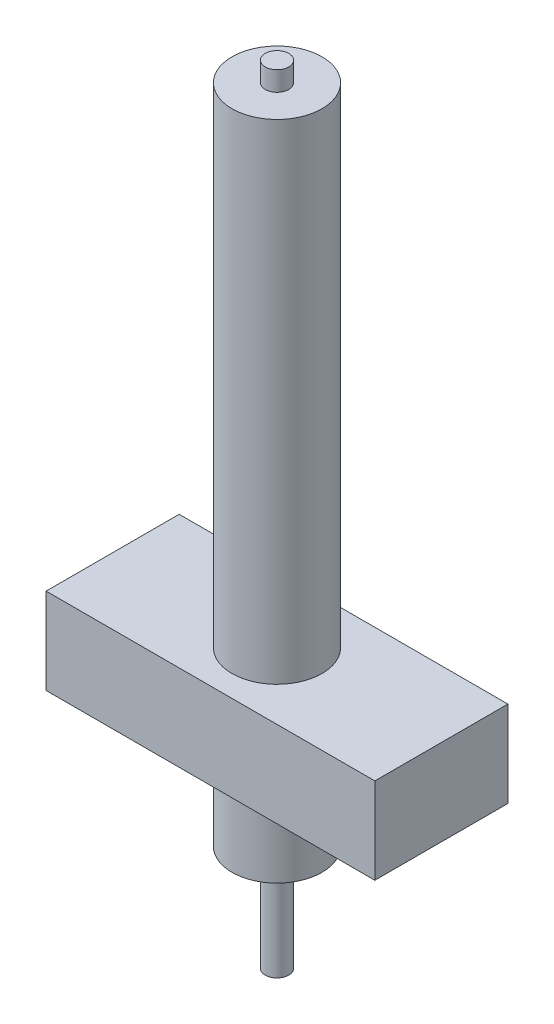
from build123d import *

# Parameters (mm, degrees)
SKETCH_1_R      = 5.75
EXTRUDE_1_DEPTH = 62.5
SKETCH_2_R      = 1.5
EXTRUDE_2_DEPTH = 2.5
SKETCH_3_W      = 42
SKETCH_3_H      = 17
EXTRUDE_3_DEPTH = 11
EXTRUDE_START   = 11
SKETCH_5_R      = 5.75
EXTRUDE_4_DEPTH = 11
EXTRUDE_START_2 = 13.5
SKETCH_6_R      = 1.5
EXTRUDE_5_DEPTH = 13.5


with BuildPart() as part:
    # Sketch 1 → Extrude 1 (new body)
    with BuildSketch(Plane(origin=(0, 0, 0), x_dir=(1, 0, 0), z_dir=(0, 1, 0))):
        with Locations(Location((0, 0, 0), (0, 0, 270))):
            Circle(SKETCH_1_R)
    extrude(amount=EXTRUDE_1_DEPTH)

    # Sketch 2 → Extrude 2 (add)
    with BuildSketch(Plane(origin=(0, 62.5, 0), x_dir=(1, 0, 0), z_dir=(0, 1, 0))):
        with Locations(Location((0, 0, 0), (0, 0, 270))):
            Circle(SKETCH_2_R)
    extrude(amount=EXTRUDE_2_DEPTH)

    # Sketch 3 → Extrude 3 (add)
    with BuildSketch(Plane.XZ):
        Rectangle(SKETCH_3_W, SKETCH_3_H)
    extrude(amount=EXTRUDE_3_DEPTH)

    # Sketch 5 → Extrude 4 (add)
    with BuildSketch(Plane.XZ.offset(11).offset(EXTRUDE_START)):
        with Locations(Location((0, 0, 0), (0, 0, 90))):
            Circle(SKETCH_5_R)
    extrude(amount=-EXTRUDE_4_DEPTH)

    # Sketch 6 → Extrude 5 (add)
    with BuildSketch(Plane.XZ.offset(22).offset(EXTRUDE_START_2)):
        with Locations(Location((0, 0, 0), (0, 0, 90))):
            Circle(SKETCH_6_R)
    extrude(amount=-EXTRUDE_5_DEPTH)


solid = part.part
